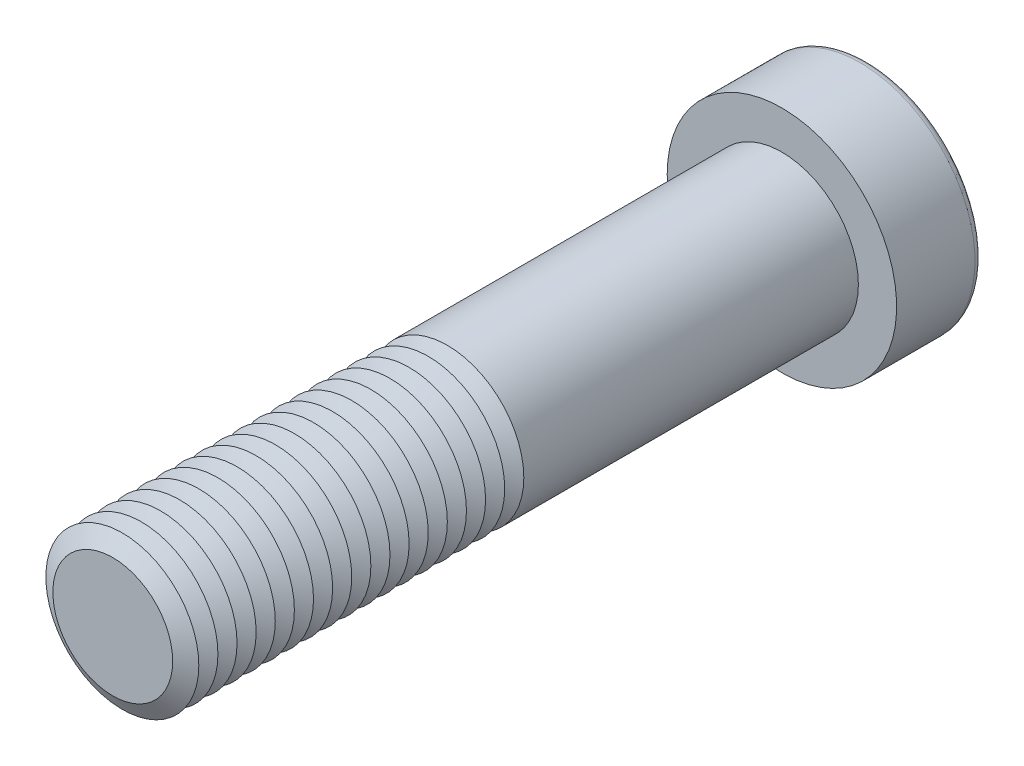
from build123d import *

# Parameters (mm, degrees)
SKETCH1_R           = 8
BOSS_EXTRUDE1_DEPTH = 70
SKETCH2_R           = 12
BOSS_EXTRUDE2_DEPTH = 9
CUT_EXTRUDE1_DEPTH  = 9
FILLET1_R           = 0.8
LPATTERN1_COUNT     = 18
LPATTERN1_PITCH     = 2


with BuildPart() as part:
    # Sketch1 → Boss-Extrude1 (new body)
    with BuildSketch(Plane.XY):
        Circle(SKETCH1_R)
    extrude(amount=BOSS_EXTRUDE1_DEPTH)

    # Sketch2 → Boss-Extrude2 (add)
    with BuildSketch(Plane(origin=(0, 0, 0), x_dir=(-1, 0, 0), z_dir=(0, 0, -1))):
        Circle(SKETCH2_R)
    extrude(amount=BOSS_EXTRUDE2_DEPTH)

    # Sketch3 → Cut-Extrude1 (cut)
    with BuildSketch(Plane(origin=(0, 0, -9), x_dir=(-1, 0, 0), z_dir=(0, 0, -1))):
        Polygon((-3.464101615, 6), (-6.92820323, 0), (-3.464101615, -6), (3.464101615, -6), (6.92820323, 0), (3.464101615, 6), align=None)
    extrude(amount=-CUT_EXTRUDE1_DEPTH, mode=Mode.SUBTRACT)

    # Fillet1
    fillet1_edges = [part.edges().sort_by_distance(p)[0] for p in [
        (12, 0, -9),
    ]]
    fillet(fillet1_edges, radius=FILLET1_R)

    # Cut-Extrude2 cone 1 section (on through the dimple's axis) → Cut-Extrude2 (revolve, cut)
    with BuildSketch(Plane.YZ):
        Polygon((0, 0), (6, 0), (0, 3.464101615), align=None)
    revolve(axis=Axis((0, 0, 0), (0, 0, 1)), mode=Mode.SUBTRACT)

    # Cut-Extrude3 cone 1 section (on through the dimple's axis) → Cut-Extrude3 (revolve, cut)
    with BuildSketch(Plane(origin=(0, 0, -9), x_dir=(0, 1, 0), z_dir=(1, 0, 0))):
        Polygon((0, 0), (6.92820323, 0), (0, 1.856406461), align=None)
    revolve(axis=Axis((0, 0, -9), (0, 0, 1)), mode=Mode.SUBTRACT)

    # Sketch7 → Cut-Revolve1 (revolve, cut)
    with BuildSketch(Plane(origin=(0, 0, 0), x_dir=(0, 0, -1), z_dir=(1, 0, 0)), mode=Mode.PRIVATE) as cut_revolve1_sk:
        Polygon((-70, 6.267949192), (-69, 8), (-71, 8), align=None)
    cut_revolve1 = revolve(cut_revolve1_sk.sketch.rotate(Axis((0, 0, 70), (0, 0, -1)), 90), axis=Axis((0, 0, 70), (0, 0, -1)), mode=Mode.SUBTRACT)

    # LPattern1: Cut-Revolve1 ×18
    with Locations(*[(0, 0, -i * LPATTERN1_PITCH) for i in range(1, LPATTERN1_COUNT)]):
        add(cut_revolve1, mode=Mode.SUBTRACT)


solid = part.part
